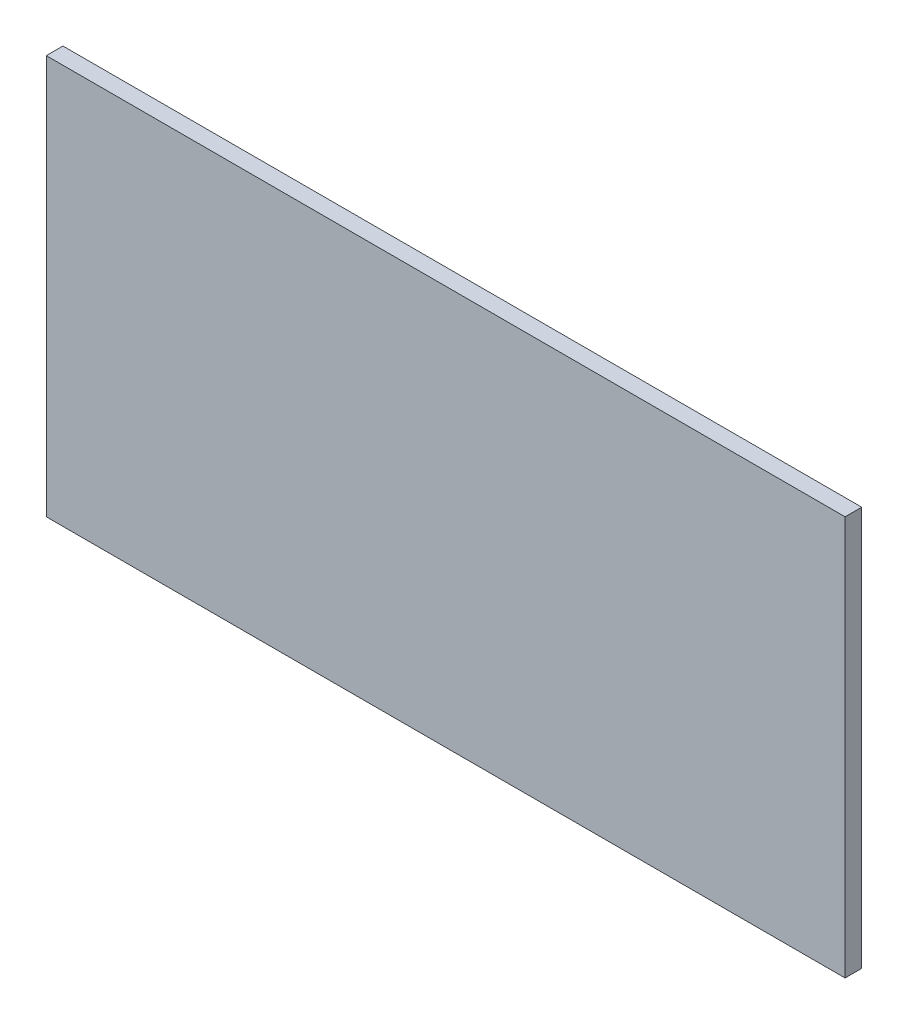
ISO-10303-21;
HEADER;
FILE_DESCRIPTION(('STEP AP214'),'2;1');
FILE_NAME('part.step','',(''),(''),'','','');
FILE_SCHEMA(('AUTOMOTIVE_DESIGN { 1 0 10303 214 1 1 1 1 }'));
ENDSEC;
DATA;
#1=APPLICATION_CONTEXT('core data for automotive mechanical design processes');
#2=APPLICATION_PROTOCOL_DEFINITION('international standard','automotive_design',2000,#1);
#3=PRODUCT_CONTEXT('',#1,'mechanical');
#4=PRODUCT('Part','Part','',(#3));
#5=PRODUCT_RELATED_PRODUCT_CATEGORY('part','',(#4));
#6=PRODUCT_DEFINITION_FORMATION('','',#4);
#7=PRODUCT_DEFINITION_CONTEXT('part definition',#1,'design');
#8=PRODUCT_DEFINITION('design','',#6,#7);
#9=PRODUCT_DEFINITION_SHAPE('','',#8);
#10=(LENGTH_UNIT() NAMED_UNIT(*) SI_UNIT(.MILLI.,.METRE.));
#11=(NAMED_UNIT(*) PLANE_ANGLE_UNIT() SI_UNIT($,.RADIAN.));
#12=(NAMED_UNIT(*) SI_UNIT($,.STERADIAN.) SOLID_ANGLE_UNIT());
#13=UNCERTAINTY_MEASURE_WITH_UNIT(LENGTH_MEASURE(1.E-05),#10,'distance_accuracy_value','');
#14=(GEOMETRIC_REPRESENTATION_CONTEXT(3) GLOBAL_UNCERTAINTY_ASSIGNED_CONTEXT((#13)) GLOBAL_UNIT_ASSIGNED_CONTEXT((#10,
#11,#12)) REPRESENTATION_CONTEXT('',''));
#15=CARTESIAN_POINT('',(0.,0.,0.));
#16=DIRECTION('',(0.,0.,1.));
#17=DIRECTION('',(1.,0.,0.));
#18=AXIS2_PLACEMENT_3D('',#15,#16,#17);
#19=CARTESIAN_POINT('',(0.,0.,12.7));
#20=DIRECTION('',(1.,0.,0.));
#21=DIRECTION('',(0.,0.,-1.));
#22=AXIS2_PLACEMENT_3D('',#19,#20,#21);
#23=PLANE('',#22);
#24=DIRECTION('',(0.,-1.,0.));
#25=VECTOR('',#24,1.);
#26=CARTESIAN_POINT('',(0.,0.,0.));
#27=LINE('',#26,#25);
#28=CARTESIAN_POINT('',(0.,304.8,0.));
#29=VERTEX_POINT('',#28);
#30=CARTESIAN_POINT('',(0.,0.,0.));
#31=VERTEX_POINT('',#30);
#32=EDGE_CURVE('E93',#29,#31,#27,.T.);
#33=ORIENTED_EDGE('',*,*,#32,.T.);
#34=DIRECTION('',(0.,0.,-1.));
#35=VECTOR('',#34,1.);
#36=CARTESIAN_POINT('',(0.,0.,12.7));
#37=LINE('',#36,#35);
#38=CARTESIAN_POINT('',(0.,0.,12.7));
#39=VERTEX_POINT('',#38);
#40=EDGE_CURVE('E11',#39,#31,#37,.T.);
#41=ORIENTED_EDGE('',*,*,#40,.F.);
#42=DIRECTION('',(0.,-1.,0.));
#43=VECTOR('',#42,1.);
#44=CARTESIAN_POINT('',(0.,0.,12.7));
#45=LINE('',#44,#43);
#46=CARTESIAN_POINT('',(0.,304.8,12.7));
#47=VERTEX_POINT('',#46);
#48=EDGE_CURVE('E81',#47,#39,#45,.T.);
#49=ORIENTED_EDGE('',*,*,#48,.F.);
#50=DIRECTION('',(0.,0.,-1.));
#51=VECTOR('',#50,1.);
#52=CARTESIAN_POINT('',(0.,304.8,12.7));
#53=LINE('',#52,#51);
#54=EDGE_CURVE('E89',#47,#29,#53,.T.);
#55=ORIENTED_EDGE('',*,*,#54,.T.);
#56=EDGE_LOOP('',(#33,#41,#49,#55));
#57=FACE_BOUND('',#56,.T.);
#58=ADVANCED_FACE('F30',(#57),#23,.F.);
#59=CARTESIAN_POINT('',(0.,0.,12.7));
#60=DIRECTION('',(0.,1.,0.));
#61=DIRECTION('',(0.,0.,1.));
#62=AXIS2_PLACEMENT_3D('',#59,#60,#61);
#63=PLANE('',#62);
#64=DIRECTION('',(1.,0.,0.));
#65=VECTOR('',#64,1.);
#66=CARTESIAN_POINT('',(0.,0.,0.));
#67=LINE('',#66,#65);
#68=CARTESIAN_POINT('',(609.6,0.,0.));
#69=VERTEX_POINT('',#68);
#70=EDGE_CURVE('E85',#31,#69,#67,.T.);
#71=ORIENTED_EDGE('',*,*,#70,.T.);
#72=DIRECTION('',(0.,0.,-1.));
#73=VECTOR('',#72,1.);
#74=CARTESIAN_POINT('',(609.6,0.,12.7));
#75=LINE('',#74,#73);
#76=CARTESIAN_POINT('',(609.6,0.,12.7));
#77=VERTEX_POINT('',#76);
#78=EDGE_CURVE('E38',#77,#69,#75,.T.);
#79=ORIENTED_EDGE('',*,*,#78,.F.);
#80=DIRECTION('',(1.,0.,0.));
#81=VECTOR('',#80,1.);
#82=CARTESIAN_POINT('',(0.,0.,12.7));
#83=LINE('',#82,#81);
#84=EDGE_CURVE('E76',#39,#77,#83,.T.);
#85=ORIENTED_EDGE('',*,*,#84,.F.);
#86=ORIENTED_EDGE('',*,*,#40,.T.);
#87=EDGE_LOOP('',(#71,#79,#85,#86));
#88=FACE_BOUND('',#87,.T.);
#89=ADVANCED_FACE('F84',(#88),#63,.F.);
#90=CARTESIAN_POINT('',(609.6,0.,12.7));
#91=DIRECTION('',(-1.,0.,0.));
#92=DIRECTION('',(0.,0.,1.));
#93=AXIS2_PLACEMENT_3D('',#90,#91,#92);
#94=PLANE('',#93);
#95=DIRECTION('',(0.,1.,0.));
#96=VECTOR('',#95,1.);
#97=CARTESIAN_POINT('',(609.6,0.,0.));
#98=LINE('',#97,#96);
#99=CARTESIAN_POINT('',(609.6,304.8,0.));
#100=VERTEX_POINT('',#99);
#101=EDGE_CURVE('E63',#69,#100,#98,.T.);
#102=ORIENTED_EDGE('',*,*,#101,.T.);
#103=DIRECTION('',(0.,0.,-1.));
#104=VECTOR('',#103,1.);
#105=CARTESIAN_POINT('',(609.6,304.8,12.7));
#106=LINE('',#105,#104);
#107=CARTESIAN_POINT('',(609.6,304.8,12.7));
#108=VERTEX_POINT('',#107);
#109=EDGE_CURVE('E86',#108,#100,#106,.T.);
#110=ORIENTED_EDGE('',*,*,#109,.F.);
#111=DIRECTION('',(0.,1.,0.));
#112=VECTOR('',#111,1.);
#113=CARTESIAN_POINT('',(609.6,0.,12.7));
#114=LINE('',#113,#112);
#115=EDGE_CURVE('E79',#77,#108,#114,.T.);
#116=ORIENTED_EDGE('',*,*,#115,.F.);
#117=ORIENTED_EDGE('',*,*,#78,.T.);
#118=EDGE_LOOP('',(#102,#110,#116,#117));
#119=FACE_BOUND('',#118,.T.);
#120=ADVANCED_FACE('F87',(#119),#94,.F.);
#121=CARTESIAN_POINT('',(0.,304.8,12.7));
#122=DIRECTION('',(0.,-1.,0.));
#123=DIRECTION('',(0.,0.,-1.));
#124=AXIS2_PLACEMENT_3D('',#121,#122,#123);
#125=PLANE('',#124);
#126=DIRECTION('',(-1.,0.,0.));
#127=VECTOR('',#126,1.);
#128=CARTESIAN_POINT('',(0.,304.8,0.));
#129=LINE('',#128,#127);
#130=EDGE_CURVE('E69',#100,#29,#129,.T.);
#131=ORIENTED_EDGE('',*,*,#130,.T.);
#132=ORIENTED_EDGE('',*,*,#54,.F.);
#133=DIRECTION('',(-1.,0.,0.));
#134=VECTOR('',#133,1.);
#135=CARTESIAN_POINT('',(0.,304.8,12.7));
#136=LINE('',#135,#134);
#137=EDGE_CURVE('E46',#108,#47,#136,.T.);
#138=ORIENTED_EDGE('',*,*,#137,.F.);
#139=ORIENTED_EDGE('',*,*,#109,.T.);
#140=EDGE_LOOP('',(#131,#132,#138,#139));
#141=FACE_BOUND('',#140,.T.);
#142=ADVANCED_FACE('F100',(#141),#125,.F.);
#143=CARTESIAN_POINT('',(0.,304.8,12.7));
#144=DIRECTION('',(0.,0.,-1.));
#145=DIRECTION('',(-1.,0.,0.));
#146=AXIS2_PLACEMENT_3D('',#143,#144,#145);
#147=PLANE('',#146);
#148=ORIENTED_EDGE('',*,*,#48,.T.);
#149=ORIENTED_EDGE('',*,*,#84,.T.);
#150=ORIENTED_EDGE('',*,*,#115,.T.);
#151=ORIENTED_EDGE('',*,*,#137,.T.);
#152=EDGE_LOOP('',(#148,#149,#150,#151));
#153=FACE_BOUND('',#152,.T.);
#154=ADVANCED_FACE('F77',(#153),#147,.F.);
#155=CARTESIAN_POINT('',(0.,304.8,0.));
#156=DIRECTION('',(0.,0.,-1.));
#157=DIRECTION('',(-1.,0.,0.));
#158=AXIS2_PLACEMENT_3D('',#155,#156,#157);
#159=PLANE('',#158);
#160=ORIENTED_EDGE('',*,*,#32,.F.);
#161=ORIENTED_EDGE('',*,*,#130,.F.);
#162=ORIENTED_EDGE('',*,*,#101,.F.);
#163=ORIENTED_EDGE('',*,*,#70,.F.);
#164=EDGE_LOOP('',(#160,#161,#162,#163));
#165=FACE_BOUND('',#164,.T.);
#166=ADVANCED_FACE('F103',(#165),#159,.T.);
#167=CLOSED_SHELL('',(#58,#89,#120,#142,#154,#166));
#168=MANIFOLD_SOLID_BREP('B2',#167);
#169=ADVANCED_BREP_SHAPE_REPRESENTATION('',(#18,#168),#14);
#170=SHAPE_DEFINITION_REPRESENTATION(#9,#169);
ENDSEC;
END-ISO-10303-21;
